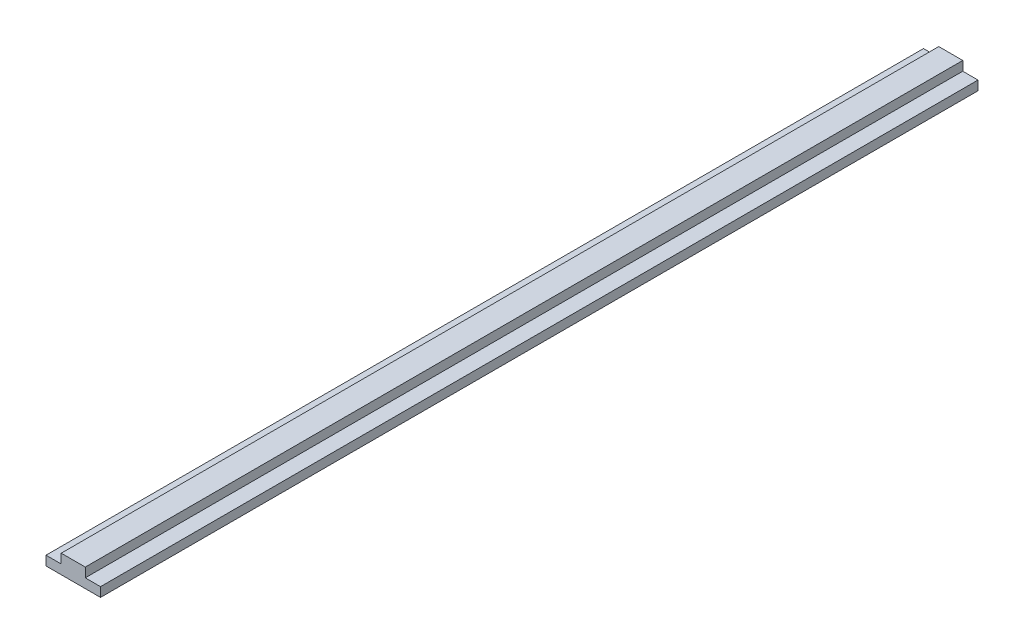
ISO-10303-21;
HEADER;
FILE_DESCRIPTION(('STEP AP214'),'2;1');
FILE_NAME('part.step','',(''),(''),'','','');
FILE_SCHEMA(('AUTOMOTIVE_DESIGN { 1 0 10303 214 1 1 1 1 }'));
ENDSEC;
DATA;
#1=APPLICATION_CONTEXT('core data for automotive mechanical design processes');
#2=APPLICATION_PROTOCOL_DEFINITION('international standard','automotive_design',2000,#1);
#3=PRODUCT_CONTEXT('',#1,'mechanical');
#4=PRODUCT('Part','Part','',(#3));
#5=PRODUCT_RELATED_PRODUCT_CATEGORY('part','',(#4));
#6=PRODUCT_DEFINITION_FORMATION('','',#4);
#7=PRODUCT_DEFINITION_CONTEXT('part definition',#1,'design');
#8=PRODUCT_DEFINITION('design','',#6,#7);
#9=PRODUCT_DEFINITION_SHAPE('','',#8);
#10=(LENGTH_UNIT() NAMED_UNIT(*) SI_UNIT(.MILLI.,.METRE.));
#11=(NAMED_UNIT(*) PLANE_ANGLE_UNIT() SI_UNIT($,.RADIAN.));
#12=(NAMED_UNIT(*) SI_UNIT($,.STERADIAN.) SOLID_ANGLE_UNIT());
#13=UNCERTAINTY_MEASURE_WITH_UNIT(LENGTH_MEASURE(1.E-05),#10,'distance_accuracy_value','');
#14=(GEOMETRIC_REPRESENTATION_CONTEXT(3) GLOBAL_UNCERTAINTY_ASSIGNED_CONTEXT((#13)) GLOBAL_UNIT_ASSIGNED_CONTEXT((#10,
#11,#12)) REPRESENTATION_CONTEXT('',''));
#15=CARTESIAN_POINT('',(0.,0.,0.));
#16=DIRECTION('',(0.,0.,1.));
#17=DIRECTION('',(1.,0.,0.));
#18=AXIS2_PLACEMENT_3D('',#15,#16,#17);
#19=CARTESIAN_POINT('',(-36.4599522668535,25.,0.));
#20=DIRECTION('',(1.,0.,0.));
#21=DIRECTION('',(0.,0.,-1.));
#22=AXIS2_PLACEMENT_3D('',#19,#20,#21);
#23=PLANE('',#22);
#24=DIRECTION('',(0.,0.,1.));
#25=VECTOR('',#24,1.);
#26=CARTESIAN_POINT('',(-36.4599522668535,12.5,0.));
#27=LINE('',#26,#25);
#28=CARTESIAN_POINT('',(-36.4599522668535,12.5,0.));
#29=VERTEX_POINT('',#28);
#30=CARTESIAN_POINT('',(-36.4599522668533,12.5,1174.));
#31=VERTEX_POINT('',#30);
#32=EDGE_CURVE('E159',#29,#31,#27,.T.);
#33=ORIENTED_EDGE('',*,*,#32,.F.);
#34=DIRECTION('',(0.,-1.,0.));
#35=VECTOR('',#34,1.);
#36=CARTESIAN_POINT('',(-36.4599522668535,25.,0.));
#37=LINE('',#36,#35);
#38=CARTESIAN_POINT('',(-36.4599522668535,0.,0.));
#39=VERTEX_POINT('',#38);
#40=EDGE_CURVE('E11',#29,#39,#37,.T.);
#41=ORIENTED_EDGE('',*,*,#40,.T.);
#42=DIRECTION('',(0.,0.,1.));
#43=VECTOR('',#42,1.);
#44=CARTESIAN_POINT('',(-36.4599522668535,0.,0.));
#45=LINE('',#44,#43);
#46=CARTESIAN_POINT('',(-36.4599522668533,0.,1174.));
#47=VERTEX_POINT('',#46);
#48=EDGE_CURVE('E144',#39,#47,#45,.T.);
#49=ORIENTED_EDGE('',*,*,#48,.T.);
#50=DIRECTION('',(0.,-1.,0.));
#51=VECTOR('',#50,1.);
#52=CARTESIAN_POINT('',(-36.4599522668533,25.,1174.));
#53=LINE('',#52,#51);
#54=EDGE_CURVE('E40',#31,#47,#53,.T.);
#55=ORIENTED_EDGE('',*,*,#54,.F.);
#56=EDGE_LOOP('',(#33,#41,#49,#55));
#57=FACE_BOUND('',#56,.T.);
#58=ADVANCED_FACE('F33',(#57),#23,.F.);
#59=CARTESIAN_POINT('',(-36.4599522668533,25.,1174.));
#60=DIRECTION('',(0.,0.,-1.));
#61=DIRECTION('',(-1.,0.,0.));
#62=AXIS2_PLACEMENT_3D('',#59,#60,#61);
#63=PLANE('',#62);
#64=DIRECTION('',(1.,0.,0.));
#65=VECTOR('',#64,1.);
#66=CARTESIAN_POINT('',(36.4599522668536,12.5,1174.));
#67=LINE('',#66,#65);
#68=CARTESIAN_POINT('',(16.0752892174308,12.5,1174.));
#69=VERTEX_POINT('',#68);
#70=CARTESIAN_POINT('',(36.4599522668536,12.5,1174.));
#71=VERTEX_POINT('',#70);
#72=EDGE_CURVE('E103',#69,#71,#67,.T.);
#73=ORIENTED_EDGE('',*,*,#72,.F.);
#74=DIRECTION('',(0.,1.,0.));
#75=VECTOR('',#74,1.);
#76=CARTESIAN_POINT('',(16.0752892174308,12.5,1174.));
#77=LINE('',#76,#75);
#78=CARTESIAN_POINT('',(16.0752892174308,25.,1174.));
#79=VERTEX_POINT('',#78);
#80=EDGE_CURVE('E160',#69,#79,#77,.T.);
#81=ORIENTED_EDGE('',*,*,#80,.T.);
#82=DIRECTION('',(1.,0.,0.));
#83=VECTOR('',#82,1.);
#84=CARTESIAN_POINT('',(-36.4599522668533,25.,1174.));
#85=LINE('',#84,#83);
#86=CARTESIAN_POINT('',(-16.0752892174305,25.,1174.));
#87=VERTEX_POINT('',#86);
#88=EDGE_CURVE('E122',#87,#79,#85,.T.);
#89=ORIENTED_EDGE('',*,*,#88,.F.);
#90=DIRECTION('',(0.,1.,0.));
#91=VECTOR('',#90,1.);
#92=CARTESIAN_POINT('',(-16.0752892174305,12.5,1174.));
#93=LINE('',#92,#91);
#94=CARTESIAN_POINT('',(-16.0752892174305,12.5,1174.));
#95=VERTEX_POINT('',#94);
#96=EDGE_CURVE('E55',#95,#87,#93,.T.);
#97=ORIENTED_EDGE('',*,*,#96,.F.);
#98=DIRECTION('',(1.,0.,0.));
#99=VECTOR('',#98,1.);
#100=CARTESIAN_POINT('',(-36.4599522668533,12.5,1174.));
#101=LINE('',#100,#99);
#102=EDGE_CURVE('E140',#31,#95,#101,.T.);
#103=ORIENTED_EDGE('',*,*,#102,.F.);
#104=ORIENTED_EDGE('',*,*,#54,.T.);
#105=DIRECTION('',(1.,0.,0.));
#106=VECTOR('',#105,1.);
#107=CARTESIAN_POINT('',(-36.4599522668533,0.,1174.));
#108=LINE('',#107,#106);
#109=CARTESIAN_POINT('',(36.4599522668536,0.,1174.));
#110=VERTEX_POINT('',#109);
#111=EDGE_CURVE('E138',#47,#110,#108,.T.);
#112=ORIENTED_EDGE('',*,*,#111,.T.);
#113=DIRECTION('',(0.,-1.,0.));
#114=VECTOR('',#113,1.);
#115=CARTESIAN_POINT('',(36.4599522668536,25.,1174.));
#116=LINE('',#115,#114);
#117=EDGE_CURVE('E121',#71,#110,#116,.T.);
#118=ORIENTED_EDGE('',*,*,#117,.F.);
#119=EDGE_LOOP('',(#73,#81,#89,#97,#103,#104,#112,#118));
#120=FACE_BOUND('',#119,.T.);
#121=ADVANCED_FACE('F136',(#120),#63,.F.);
#122=CARTESIAN_POINT('',(36.4599522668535,25.,0.));
#123=DIRECTION('',(-1.,0.,0.));
#124=DIRECTION('',(0.,0.,1.));
#125=AXIS2_PLACEMENT_3D('',#122,#123,#124);
#126=PLANE('',#125);
#127=DIRECTION('',(0.,-1.,0.));
#128=VECTOR('',#127,1.);
#129=CARTESIAN_POINT('',(36.4599522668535,25.,0.));
#130=LINE('',#129,#128);
#131=CARTESIAN_POINT('',(36.4599522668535,12.5,0.));
#132=VERTEX_POINT('',#131);
#133=CARTESIAN_POINT('',(36.4599522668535,0.,0.));
#134=VERTEX_POINT('',#133);
#135=EDGE_CURVE('E113',#132,#134,#130,.T.);
#136=ORIENTED_EDGE('',*,*,#135,.F.);
#137=DIRECTION('',(0.,0.,-1.));
#138=VECTOR('',#137,1.);
#139=CARTESIAN_POINT('',(36.4599522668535,12.5,0.));
#140=LINE('',#139,#138);
#141=EDGE_CURVE('E97',#71,#132,#140,.T.);
#142=ORIENTED_EDGE('',*,*,#141,.F.);
#143=ORIENTED_EDGE('',*,*,#117,.T.);
#144=DIRECTION('',(0.,0.,-1.));
#145=VECTOR('',#144,1.);
#146=CARTESIAN_POINT('',(36.4599522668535,0.,0.));
#147=LINE('',#146,#145);
#148=EDGE_CURVE('E119',#110,#134,#147,.T.);
#149=ORIENTED_EDGE('',*,*,#148,.T.);
#150=EDGE_LOOP('',(#136,#142,#143,#149));
#151=FACE_BOUND('',#150,.T.);
#152=ADVANCED_FACE('F117',(#151),#126,.F.);
#153=CARTESIAN_POINT('',(0.,25.,0.));
#154=DIRECTION('',(0.,0.,1.));
#155=DIRECTION('',(1.,0.,0.));
#156=AXIS2_PLACEMENT_3D('',#153,#154,#155);
#157=PLANE('',#156);
#158=DIRECTION('',(-1.,0.,0.));
#159=VECTOR('',#158,1.);
#160=CARTESIAN_POINT('',(-36.4599522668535,25.,0.));
#161=LINE('',#160,#159);
#162=CARTESIAN_POINT('',(16.0752892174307,25.,0.));
#163=VERTEX_POINT('',#162);
#164=CARTESIAN_POINT('',(-16.0752892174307,25.,0.));
#165=VERTEX_POINT('',#164);
#166=EDGE_CURVE('E126',#163,#165,#161,.T.);
#167=ORIENTED_EDGE('',*,*,#166,.F.);
#168=DIRECTION('',(0.,1.,0.));
#169=VECTOR('',#168,1.);
#170=CARTESIAN_POINT('',(16.0752892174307,12.5,0.));
#171=LINE('',#170,#169);
#172=CARTESIAN_POINT('',(16.0752892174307,12.5,0.));
#173=VERTEX_POINT('',#172);
#174=EDGE_CURVE('E47',#173,#163,#171,.T.);
#175=ORIENTED_EDGE('',*,*,#174,.F.);
#176=DIRECTION('',(-1.,0.,0.));
#177=VECTOR('',#176,1.);
#178=CARTESIAN_POINT('',(36.4599522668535,12.5,0.));
#179=LINE('',#178,#177);
#180=EDGE_CURVE('E101',#132,#173,#179,.T.);
#181=ORIENTED_EDGE('',*,*,#180,.F.);
#182=ORIENTED_EDGE('',*,*,#135,.T.);
#183=DIRECTION('',(-1.,0.,0.));
#184=VECTOR('',#183,1.);
#185=CARTESIAN_POINT('',(0.,0.,0.));
#186=LINE('',#185,#184);
#187=EDGE_CURVE('E129',#134,#39,#186,.T.);
#188=ORIENTED_EDGE('',*,*,#187,.T.);
#189=ORIENTED_EDGE('',*,*,#40,.F.);
#190=DIRECTION('',(-1.,0.,0.));
#191=VECTOR('',#190,1.);
#192=CARTESIAN_POINT('',(-36.4599522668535,12.5,0.));
#193=LINE('',#192,#191);
#194=CARTESIAN_POINT('',(-16.0752892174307,12.5,0.));
#195=VERTEX_POINT('',#194);
#196=EDGE_CURVE('E154',#195,#29,#193,.T.);
#197=ORIENTED_EDGE('',*,*,#196,.F.);
#198=DIRECTION('',(0.,1.,0.));
#199=VECTOR('',#198,1.);
#200=CARTESIAN_POINT('',(-16.0752892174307,12.5,0.));
#201=LINE('',#200,#199);
#202=EDGE_CURVE('E147',#195,#165,#201,.T.);
#203=ORIENTED_EDGE('',*,*,#202,.T.);
#204=EDGE_LOOP('',(#167,#175,#181,#182,#188,#189,#197,#203));
#205=FACE_BOUND('',#204,.T.);
#206=ADVANCED_FACE('F111',(#205),#157,.F.);
#207=CARTESIAN_POINT('',(0.,25.,0.));
#208=DIRECTION('',(0.,-1.,0.));
#209=DIRECTION('',(0.,0.,-1.));
#210=AXIS2_PLACEMENT_3D('',#207,#208,#209);
#211=PLANE('',#210);
#212=ORIENTED_EDGE('',*,*,#88,.T.);
#213=DIRECTION('',(0.,0.,1.));
#214=VECTOR('',#213,1.);
#215=CARTESIAN_POINT('',(16.0752892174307,25.,0.));
#216=LINE('',#215,#214);
#217=EDGE_CURVE('E107',#163,#79,#216,.T.);
#218=ORIENTED_EDGE('',*,*,#217,.F.);
#219=ORIENTED_EDGE('',*,*,#166,.T.);
#220=DIRECTION('',(0.,0.,-1.));
#221=VECTOR('',#220,1.);
#222=CARTESIAN_POINT('',(-16.0752892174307,25.,0.));
#223=LINE('',#222,#221);
#224=EDGE_CURVE('E157',#87,#165,#223,.T.);
#225=ORIENTED_EDGE('',*,*,#224,.F.);
#226=EDGE_LOOP('',(#212,#218,#219,#225));
#227=FACE_BOUND('',#226,.T.);
#228=ADVANCED_FACE('F174',(#227),#211,.F.);
#229=CARTESIAN_POINT('',(0.,0.,0.));
#230=DIRECTION('',(0.,-1.,0.));
#231=DIRECTION('',(0.,0.,-1.));
#232=AXIS2_PLACEMENT_3D('',#229,#230,#231);
#233=PLANE('',#232);
#234=ORIENTED_EDGE('',*,*,#48,.F.);
#235=ORIENTED_EDGE('',*,*,#187,.F.);
#236=ORIENTED_EDGE('',*,*,#148,.F.);
#237=ORIENTED_EDGE('',*,*,#111,.F.);
#238=EDGE_LOOP('',(#234,#235,#236,#237));
#239=FACE_BOUND('',#238,.T.);
#240=ADVANCED_FACE('F149',(#239),#233,.T.);
#241=CARTESIAN_POINT('',(-16.0752892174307,12.5,0.));
#242=DIRECTION('',(1.,0.,0.));
#243=DIRECTION('',(0.,0.,-1.));
#244=AXIS2_PLACEMENT_3D('',#241,#242,#243);
#245=PLANE('',#244);
#246=ORIENTED_EDGE('',*,*,#224,.T.);
#247=ORIENTED_EDGE('',*,*,#202,.F.);
#248=DIRECTION('',(0.,0.,-1.));
#249=VECTOR('',#248,1.);
#250=CARTESIAN_POINT('',(-16.0752892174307,12.5,0.));
#251=LINE('',#250,#249);
#252=EDGE_CURVE('E162',#95,#195,#251,.T.);
#253=ORIENTED_EDGE('',*,*,#252,.F.);
#254=ORIENTED_EDGE('',*,*,#96,.T.);
#255=EDGE_LOOP('',(#246,#247,#253,#254));
#256=FACE_BOUND('',#255,.T.);
#257=ADVANCED_FACE('F175',(#256),#245,.F.);
#258=CARTESIAN_POINT('',(0.,12.5,0.));
#259=DIRECTION('',(0.,1.,0.));
#260=DIRECTION('',(0.,0.,1.));
#261=AXIS2_PLACEMENT_3D('',#258,#259,#260);
#262=PLANE('',#261);
#263=ORIENTED_EDGE('',*,*,#32,.T.);
#264=ORIENTED_EDGE('',*,*,#102,.T.);
#265=ORIENTED_EDGE('',*,*,#252,.T.);
#266=ORIENTED_EDGE('',*,*,#196,.T.);
#267=EDGE_LOOP('',(#263,#264,#265,#266));
#268=FACE_BOUND('',#267,.T.);
#269=ADVANCED_FACE('F178',(#268),#262,.T.);
#270=CARTESIAN_POINT('',(16.0752892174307,12.5,0.));
#271=DIRECTION('',(-1.,0.,0.));
#272=DIRECTION('',(0.,0.,1.));
#273=AXIS2_PLACEMENT_3D('',#270,#271,#272);
#274=PLANE('',#273);
#275=ORIENTED_EDGE('',*,*,#217,.T.);
#276=ORIENTED_EDGE('',*,*,#80,.F.);
#277=DIRECTION('',(0.,0.,1.));
#278=VECTOR('',#277,1.);
#279=CARTESIAN_POINT('',(16.0752892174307,12.5,0.));
#280=LINE('',#279,#278);
#281=EDGE_CURVE('E115',#173,#69,#280,.T.);
#282=ORIENTED_EDGE('',*,*,#281,.F.);
#283=ORIENTED_EDGE('',*,*,#174,.T.);
#284=EDGE_LOOP('',(#275,#276,#282,#283));
#285=FACE_BOUND('',#284,.T.);
#286=ADVANCED_FACE('F180',(#285),#274,.F.);
#287=CARTESIAN_POINT('',(0.,12.5,0.));
#288=DIRECTION('',(0.,-1.,0.));
#289=DIRECTION('',(0.,0.,-1.));
#290=AXIS2_PLACEMENT_3D('',#287,#288,#289);
#291=PLANE('',#290);
#292=ORIENTED_EDGE('',*,*,#141,.T.);
#293=ORIENTED_EDGE('',*,*,#180,.T.);
#294=ORIENTED_EDGE('',*,*,#281,.T.);
#295=ORIENTED_EDGE('',*,*,#72,.T.);
#296=EDGE_LOOP('',(#292,#293,#294,#295));
#297=FACE_BOUND('',#296,.T.);
#298=ADVANCED_FACE('F99',(#297),#291,.F.);
#299=CLOSED_SHELL('',(#58,#121,#152,#206,#228,#240,#257,#269,#286,#298));
#300=MANIFOLD_SOLID_BREP('B2',#299);
#301=ADVANCED_BREP_SHAPE_REPRESENTATION('',(#18,#300),#14);
#302=SHAPE_DEFINITION_REPRESENTATION(#9,#301);
ENDSEC;
END-ISO-10303-21;
